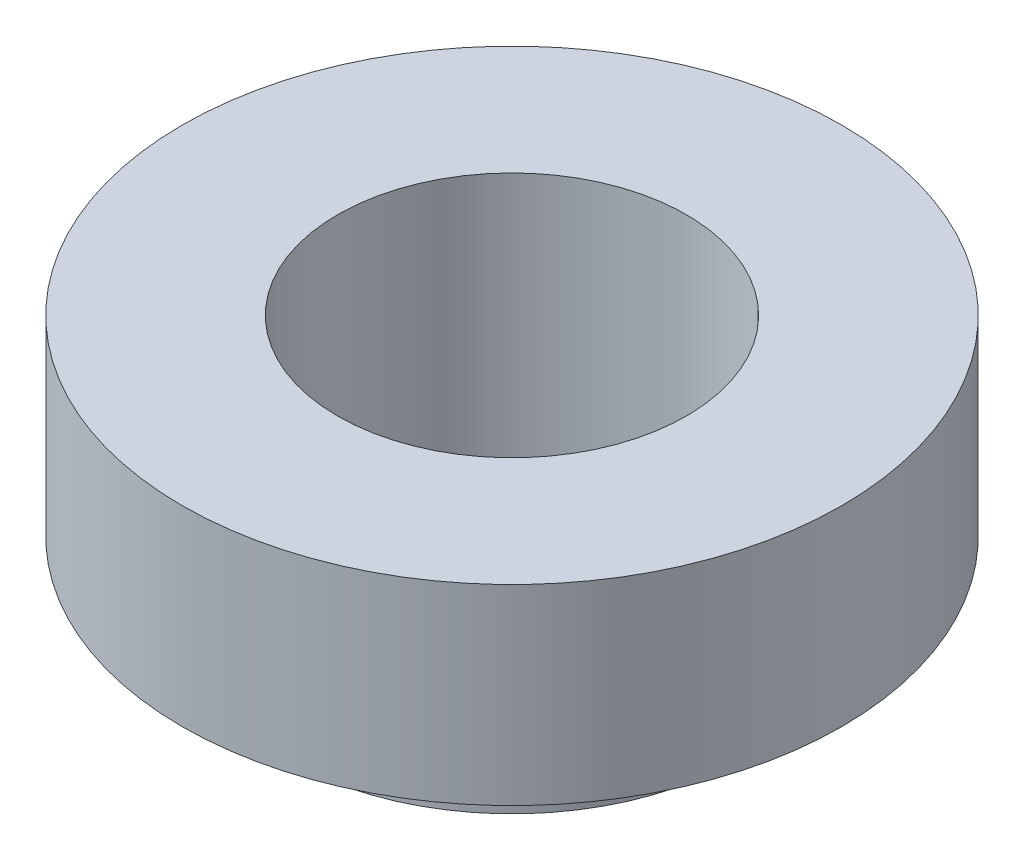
from build123d import *

# Parameters (mm, degrees)
SKETCH1_R           = 2.6924
BASE_EXTRUDE_DEPTH  = 0.9652
SKETCH2_R           = 3.937
BOSS_EXTRUDE1_DEPTH = 2.286
SKETCH3_R           = 2.0828
CUT_EXTRUDE1_DEPTH  = 7.447498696


with BuildPart() as part:
    # Sketch1 → Base-Extrude (new body)
    with BuildSketch(Plane(origin=(0, 0, 0), x_dir=(1, 0, 0), z_dir=(0, 1, 0))):
        with Locations(Location((0, 0, 0), (0, 0, 90))):
            Circle(SKETCH1_R)
    extrude(amount=BASE_EXTRUDE_DEPTH)

    # Sketch2 → Boss-Extrude1 (add)
    with BuildSketch(Plane(origin=(0, 0.9652, 0), x_dir=(-1, 0, 0), z_dir=(0, 1, 0))):
        with Locations(Location((0, 0, 0), (0, 0, 90))):
            Circle(SKETCH2_R)
    extrude(amount=BOSS_EXTRUDE1_DEPTH)

    # Sketch3 → Cut-Extrude1 (cut, through all)
    with BuildSketch(Plane(origin=(0, 3.2512, 0), x_dir=(-1, 0, 0), z_dir=(0, 1, 0))):
        with Locations(Location((0, 0, 0), (0, 0, 90))):
            Circle(SKETCH3_R)
    extrude(amount=-CUT_EXTRUDE1_DEPTH, mode=Mode.SUBTRACT)


solid = part.part
